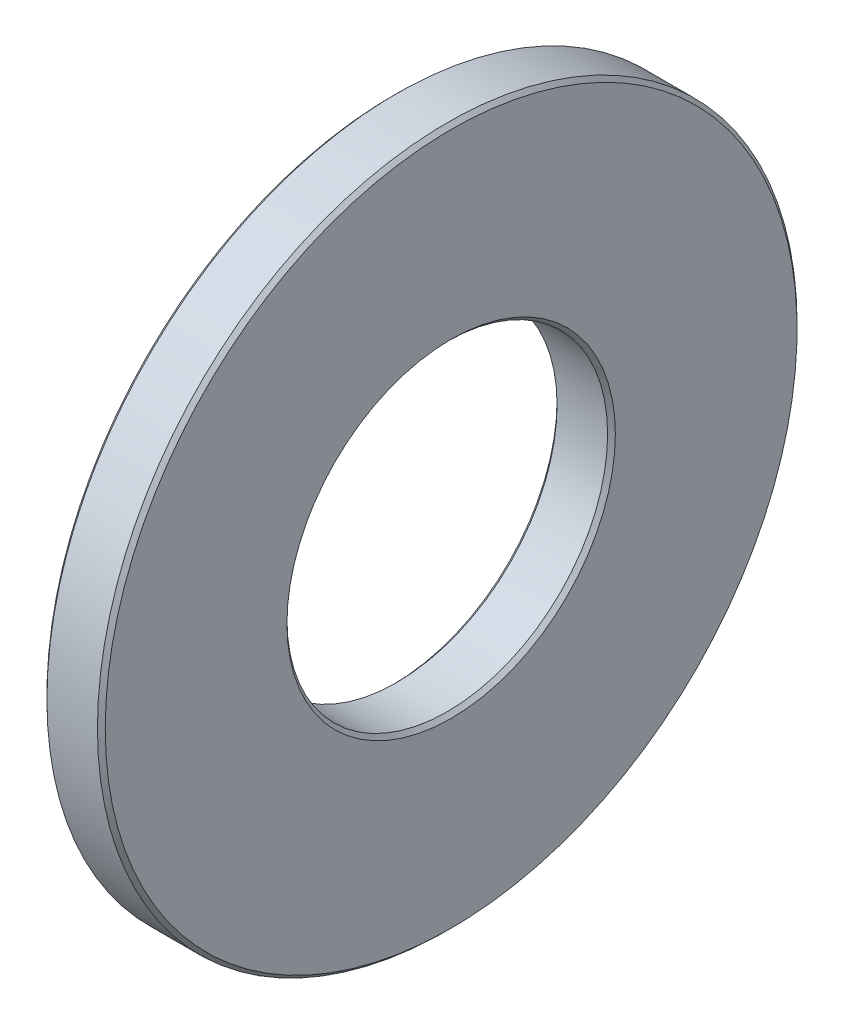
ISO-10303-21;
HEADER;
FILE_DESCRIPTION(('STEP AP214'),'2;1');
FILE_NAME('part.step','',(''),(''),'','','');
FILE_SCHEMA(('AUTOMOTIVE_DESIGN { 1 0 10303 214 1 1 1 1 }'));
ENDSEC;
DATA;
#1=APPLICATION_CONTEXT('core data for automotive mechanical design processes');
#2=APPLICATION_PROTOCOL_DEFINITION('international standard','automotive_design',2000,#1);
#3=PRODUCT_CONTEXT('',#1,'mechanical');
#4=PRODUCT('Part','Part','',(#3));
#5=PRODUCT_RELATED_PRODUCT_CATEGORY('part','',(#4));
#6=PRODUCT_DEFINITION_FORMATION('','',#4);
#7=PRODUCT_DEFINITION_CONTEXT('part definition',#1,'design');
#8=PRODUCT_DEFINITION('design','',#6,#7);
#9=PRODUCT_DEFINITION_SHAPE('','',#8);
#10=(LENGTH_UNIT() NAMED_UNIT(*) SI_UNIT(.MILLI.,.METRE.));
#11=(NAMED_UNIT(*) PLANE_ANGLE_UNIT() SI_UNIT($,.RADIAN.));
#12=(NAMED_UNIT(*) SI_UNIT($,.STERADIAN.) SOLID_ANGLE_UNIT());
#13=UNCERTAINTY_MEASURE_WITH_UNIT(LENGTH_MEASURE(1.E-05),#10,'distance_accuracy_value','');
#14=(GEOMETRIC_REPRESENTATION_CONTEXT(3) GLOBAL_UNCERTAINTY_ASSIGNED_CONTEXT((#13)) GLOBAL_UNIT_ASSIGNED_CONTEXT((#10,
#11,#12)) REPRESENTATION_CONTEXT('',''));
#15=CARTESIAN_POINT('',(0.,0.,0.));
#16=DIRECTION('',(0.,0.,1.));
#17=DIRECTION('',(1.,0.,0.));
#18=AXIS2_PLACEMENT_3D('',#15,#16,#17);
#19=CARTESIAN_POINT('',(0.,4.125,0.));
#20=DIRECTION('',(1.,0.,0.));
#21=DIRECTION('',(0.,0.,-1.));
#22=AXIS2_PLACEMENT_3D('',#19,#20,#21);
#23=PLANE('',#22);
#24=CARTESIAN_POINT('',(0.,0.,0.));
#25=DIRECTION('',(1.,0.,0.));
#26=DIRECTION('',(0.,0.,-1.));
#27=AXIS2_PLACEMENT_3D('',#24,#25,#26);
#28=CIRCLE('',#27,4.225);
#29=CARTESIAN_POINT('',(0.,0.,-4.225));
#30=VERTEX_POINT('',#29);
#31=EDGE_CURVE('E45',#30,#30,#28,.T.);
#32=ORIENTED_EDGE('',*,*,#31,.T.);
#33=EDGE_LOOP('',(#32));
#34=FACE_BOUND('',#33,.T.);
#35=CARTESIAN_POINT('',(0.,0.,0.));
#36=DIRECTION('',(1.,0.,0.));
#37=DIRECTION('',(0.,0.,-1.));
#38=AXIS2_PLACEMENT_3D('',#35,#36,#37);
#39=CIRCLE('',#38,8.9);
#40=CARTESIAN_POINT('',(0.,0.,-8.9));
#41=VERTEX_POINT('',#40);
#42=EDGE_CURVE('E49',#41,#41,#39,.F.);
#43=ORIENTED_EDGE('',*,*,#42,.T.);
#44=EDGE_LOOP('',(#43));
#45=FACE_BOUND('',#44,.T.);
#46=ADVANCED_FACE('F35',(#34,#45),#23,.F.);
#47=CARTESIAN_POINT('',(0.,0.,0.));
#48=DIRECTION('',(-1.,0.,0.));
#49=DIRECTION('',(0.,0.,1.));
#50=AXIS2_PLACEMENT_3D('',#47,#48,#49);
#51=CYLINDRICAL_SURFACE('',#50,9.);
#52=CARTESIAN_POINT('',(1.4,0.,0.));
#53=DIRECTION('',(-1.,0.,0.));
#54=DIRECTION('',(0.,0.,1.));
#55=AXIS2_PLACEMENT_3D('',#52,#53,#54);
#56=CIRCLE('',#55,9.);
#57=CARTESIAN_POINT('',(1.4,0.,9.));
#58=VERTEX_POINT('',#57);
#59=EDGE_CURVE('E10',#58,#58,#56,.T.);
#60=ORIENTED_EDGE('',*,*,#59,.T.);
#61=EDGE_LOOP('',(#60));
#62=FACE_BOUND('',#61,.T.);
#63=CARTESIAN_POINT('',(0.0999999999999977,0.,0.));
#64=DIRECTION('',(1.,0.,0.));
#65=DIRECTION('',(0.,0.,-1.));
#66=AXIS2_PLACEMENT_3D('',#63,#64,#65);
#67=CIRCLE('',#66,9.);
#68=CARTESIAN_POINT('',(0.0999999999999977,0.,-9.));
#69=VERTEX_POINT('',#68);
#70=EDGE_CURVE('E41',#69,#69,#67,.T.);
#71=ORIENTED_EDGE('',*,*,#70,.T.);
#72=EDGE_LOOP('',(#71));
#73=FACE_BOUND('',#72,.T.);
#74=ADVANCED_FACE('F85',(#62,#73),#51,.T.);
#75=CARTESIAN_POINT('',(1.5,4.125,0.));
#76=DIRECTION('',(-1.,0.,0.));
#77=DIRECTION('',(0.,0.,1.));
#78=AXIS2_PLACEMENT_3D('',#75,#76,#77);
#79=PLANE('',#78);
#80=CARTESIAN_POINT('',(1.5,0.,0.));
#81=DIRECTION('',(-1.,0.,0.));
#82=DIRECTION('',(0.,0.,1.));
#83=AXIS2_PLACEMENT_3D('',#80,#81,#82);
#84=CIRCLE('',#83,4.225);
#85=CARTESIAN_POINT('',(1.5,0.,-4.225));
#86=VERTEX_POINT('',#85);
#87=EDGE_CURVE('E60',#86,#86,#84,.T.);
#88=ORIENTED_EDGE('',*,*,#87,.T.);
#89=EDGE_LOOP('',(#88));
#90=FACE_BOUND('',#89,.T.);
#91=CARTESIAN_POINT('',(1.5,0.,0.));
#92=DIRECTION('',(-1.,0.,0.));
#93=DIRECTION('',(0.,0.,1.));
#94=AXIS2_PLACEMENT_3D('',#91,#92,#93);
#95=CIRCLE('',#94,8.9);
#96=CARTESIAN_POINT('',(1.5,0.,8.9));
#97=VERTEX_POINT('',#96);
#98=EDGE_CURVE('E63',#97,#97,#95,.F.);
#99=ORIENTED_EDGE('',*,*,#98,.T.);
#100=EDGE_LOOP('',(#99));
#101=FACE_BOUND('',#100,.T.);
#102=ADVANCED_FACE('F67',(#90,#101),#79,.F.);
#103=CARTESIAN_POINT('',(0.,0.,0.));
#104=DIRECTION('',(-1.,0.,0.));
#105=DIRECTION('',(0.,0.,1.));
#106=AXIS2_PLACEMENT_3D('',#103,#104,#105);
#107=CYLINDRICAL_SURFACE('',#106,4.125);
#108=CARTESIAN_POINT('',(1.4,0.,0.));
#109=DIRECTION('',(-1.,0.,0.));
#110=DIRECTION('',(0.,0.,1.));
#111=AXIS2_PLACEMENT_3D('',#108,#109,#110);
#112=CIRCLE('',#111,4.125);
#113=CARTESIAN_POINT('',(1.4,0.,-4.125));
#114=VERTEX_POINT('',#113);
#115=EDGE_CURVE('E54',#114,#114,#112,.F.);
#116=ORIENTED_EDGE('',*,*,#115,.T.);
#117=EDGE_LOOP('',(#116));
#118=FACE_BOUND('',#117,.T.);
#119=CARTESIAN_POINT('',(0.1,0.,0.));
#120=DIRECTION('',(1.,0.,0.));
#121=DIRECTION('',(0.,0.,-1.));
#122=AXIS2_PLACEMENT_3D('',#119,#120,#121);
#123=CIRCLE('',#122,4.125);
#124=CARTESIAN_POINT('',(0.1,0.,-4.125));
#125=VERTEX_POINT('',#124);
#126=EDGE_CURVE('E57',#125,#125,#123,.F.);
#127=ORIENTED_EDGE('',*,*,#126,.T.);
#128=EDGE_LOOP('',(#127));
#129=FACE_BOUND('',#128,.T.);
#130=ADVANCED_FACE('F97',(#118,#129),#107,.F.);
#131=CARTESIAN_POINT('',(1.5,0.,0.));
#132=DIRECTION('',(1.,0.,0.));
#133=DIRECTION('',(0.,0.,-1.));
#134=AXIS2_PLACEMENT_3D('',#131,#132,#133);
#135=CONICAL_SURFACE('',#134,4.225,0.78539816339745);
#136=CARTESIAN_POINT('',(1.4,0.,-4.125));
#137=CARTESIAN_POINT('',(1.40104166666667,0.,-4.12604166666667));
#138=CARTESIAN_POINT('',(1.40208333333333,0.,-4.12708333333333));
#139=CARTESIAN_POINT('',(1.40416666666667,0.,-4.12916666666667));
#140=CARTESIAN_POINT('',(1.40520833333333,0.,-4.13020833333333));
#141=CARTESIAN_POINT('',(1.40729166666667,0.,-4.13229166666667));
#142=CARTESIAN_POINT('',(1.40833333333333,0.,-4.13333333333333));
#143=CARTESIAN_POINT('',(1.41041666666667,0.,-4.13541666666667));
#144=CARTESIAN_POINT('',(1.41145833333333,0.,-4.13645833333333));
#145=CARTESIAN_POINT('',(1.41354166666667,0.,-4.13854166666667));
#146=CARTESIAN_POINT('',(1.41458333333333,0.,-4.13958333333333));
#147=CARTESIAN_POINT('',(1.41666666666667,0.,-4.14166666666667));
#148=CARTESIAN_POINT('',(1.41770833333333,0.,-4.14270833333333));
#149=CARTESIAN_POINT('',(1.41979166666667,0.,-4.14479166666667));
#150=CARTESIAN_POINT('',(1.42083333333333,0.,-4.14583333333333));
#151=CARTESIAN_POINT('',(1.42291666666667,0.,-4.14791666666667));
#152=CARTESIAN_POINT('',(1.42395833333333,0.,-4.14895833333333));
#153=CARTESIAN_POINT('',(1.42604166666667,0.,-4.15104166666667));
#154=CARTESIAN_POINT('',(1.42708333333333,0.,-4.15208333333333));
#155=CARTESIAN_POINT('',(1.42916666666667,0.,-4.15416666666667));
#156=CARTESIAN_POINT('',(1.43020833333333,0.,-4.15520833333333));
#157=CARTESIAN_POINT('',(1.43229166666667,0.,-4.15729166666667));
#158=CARTESIAN_POINT('',(1.43333333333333,0.,-4.15833333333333));
#159=CARTESIAN_POINT('',(1.43541666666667,0.,-4.16041666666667));
#160=CARTESIAN_POINT('',(1.43645833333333,0.,-4.16145833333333));
#161=CARTESIAN_POINT('',(1.43854166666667,0.,-4.16354166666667));
#162=CARTESIAN_POINT('',(1.43958333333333,0.,-4.16458333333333));
#163=CARTESIAN_POINT('',(1.44166666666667,0.,-4.16666666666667));
#164=CARTESIAN_POINT('',(1.44270833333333,0.,-4.16770833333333));
#165=CARTESIAN_POINT('',(1.44479166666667,0.,-4.16979166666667));
#166=CARTESIAN_POINT('',(1.44583333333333,0.,-4.17083333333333));
#167=CARTESIAN_POINT('',(1.44791666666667,0.,-4.17291666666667));
#168=CARTESIAN_POINT('',(1.44895833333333,0.,-4.17395833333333));
#169=CARTESIAN_POINT('',(1.45104166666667,0.,-4.17604166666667));
#170=CARTESIAN_POINT('',(1.45208333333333,0.,-4.17708333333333));
#171=CARTESIAN_POINT('',(1.45416666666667,0.,-4.17916666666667));
#172=CARTESIAN_POINT('',(1.45520833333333,0.,-4.18020833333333));
#173=CARTESIAN_POINT('',(1.45729166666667,0.,-4.18229166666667));
#174=CARTESIAN_POINT('',(1.45833333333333,0.,-4.18333333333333));
#175=CARTESIAN_POINT('',(1.46041666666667,0.,-4.18541666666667));
#176=CARTESIAN_POINT('',(1.46145833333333,0.,-4.18645833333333));
#177=CARTESIAN_POINT('',(1.46354166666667,0.,-4.18854166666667));
#178=CARTESIAN_POINT('',(1.46458333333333,0.,-4.18958333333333));
#179=CARTESIAN_POINT('',(1.46666666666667,0.,-4.19166666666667));
#180=CARTESIAN_POINT('',(1.46770833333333,0.,-4.19270833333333));
#181=CARTESIAN_POINT('',(1.46979166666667,0.,-4.19479166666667));
#182=CARTESIAN_POINT('',(1.47083333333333,0.,-4.19583333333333));
#183=CARTESIAN_POINT('',(1.47291666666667,0.,-4.19791666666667));
#184=CARTESIAN_POINT('',(1.47395833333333,0.,-4.19895833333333));
#185=CARTESIAN_POINT('',(1.47604166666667,0.,-4.20104166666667));
#186=CARTESIAN_POINT('',(1.47708333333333,0.,-4.20208333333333));
#187=CARTESIAN_POINT('',(1.47916666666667,0.,-4.20416666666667));
#188=CARTESIAN_POINT('',(1.48020833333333,0.,-4.20520833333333));
#189=CARTESIAN_POINT('',(1.48229166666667,0.,-4.20729166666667));
#190=CARTESIAN_POINT('',(1.48333333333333,0.,-4.20833333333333));
#191=CARTESIAN_POINT('',(1.48541666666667,0.,-4.21041666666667));
#192=CARTESIAN_POINT('',(1.48645833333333,0.,-4.21145833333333));
#193=CARTESIAN_POINT('',(1.48854166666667,0.,-4.21354166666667));
#194=CARTESIAN_POINT('',(1.48958333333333,0.,-4.21458333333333));
#195=CARTESIAN_POINT('',(1.49166666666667,0.,-4.21666666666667));
#196=CARTESIAN_POINT('',(1.49270833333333,0.,-4.21770833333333));
#197=CARTESIAN_POINT('',(1.49479166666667,0.,-4.21979166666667));
#198=CARTESIAN_POINT('',(1.49583333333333,0.,-4.22083333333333));
#199=CARTESIAN_POINT('',(1.49791666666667,0.,-4.22291666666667));
#200=CARTESIAN_POINT('',(1.49895833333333,0.,-4.22395833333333));
#201=CARTESIAN_POINT('',(1.5,0.,-4.225));
#202=B_SPLINE_CURVE_WITH_KNOTS('',3,(#136,#137,#138,#139,#140,#141,#142,#143,#144,#145,#146,
#147,#148,#149,#150,#151,#152,#153,#154,#155,#156,#157,#158,#159,#160,#161,#162,#163,#164,#165,
#166,#167,#168,#169,#170,#171,#172,#173,#174,#175,#176,#177,#178,#179,#180,#181,#182,#183,#184,
#185,#186,#187,#188,#189,#190,#191,#192,#193,#194,#195,#196,#197,#198,#199,#200,#201),
.UNSPECIFIED.,.F.,.F.,(4,2,2,2,2,2,2,2,2,2,2,2,2,2,2,2,2,2,2,2,2,2,2,2,2,2,2,2,2,2,2,2,4),(0.,
0.0044194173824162,0.00883883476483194,0.0132582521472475,0.0176776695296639,0.0220970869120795,
0.0265165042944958,0.0309359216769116,0.0353553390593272,0.0397747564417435,0.0441941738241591,
0.0486135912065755,0.0530330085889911,0.0574524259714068,0.061871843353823,0.0662912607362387,
0.0707106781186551,0.0751300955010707,0.0795495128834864,0.0839689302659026,0.0883883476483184,
0.0928077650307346,0.0972271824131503,0.101646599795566,0.106066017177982,0.110485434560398,
0.114904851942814,0.11932426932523,0.123743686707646,0.128163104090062,0.132582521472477,
0.137001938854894,0.141421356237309),.UNSPECIFIED.);
#203=EDGE_CURVE('BSEAM81',#114,#86,#202,.T.);
#204=ORIENTED_EDGE('',*,*,#115,.F.);
#205=ORIENTED_EDGE('',*,*,#87,.F.);
#206=ORIENTED_EDGE('',*,*,#203,.T.);
#207=ORIENTED_EDGE('',*,*,#203,.F.);
#208=EDGE_LOOP('',(#204,#206,#205,#207));
#209=FACE_BOUND('',#208,.T.);
#210=ADVANCED_FACE('F81',(#209),#135,.F.);
#211=CARTESIAN_POINT('',(0.1,0.,0.));
#212=DIRECTION('',(-1.,0.,0.));
#213=DIRECTION('',(0.,0.,1.));
#214=AXIS2_PLACEMENT_3D('',#211,#212,#213);
#215=CONICAL_SURFACE('',#214,4.125,0.785398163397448);
#216=ORIENTED_EDGE('',*,*,#31,.F.);
#217=EDGE_LOOP('',(#216));
#218=FACE_BOUND('',#217,.T.);
#219=ORIENTED_EDGE('',*,*,#126,.F.);
#220=EDGE_LOOP('',(#219));
#221=FACE_BOUND('',#220,.T.);
#222=ADVANCED_FACE('F73',(#218,#221),#215,.F.);
#223=CARTESIAN_POINT('',(1.4,0.,0.));
#224=DIRECTION('',(-1.,0.,0.));
#225=DIRECTION('',(0.,0.,1.));
#226=AXIS2_PLACEMENT_3D('',#223,#224,#225);
#227=CONICAL_SURFACE('',#226,9.,0.785398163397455);
#228=ORIENTED_EDGE('',*,*,#98,.F.);
#229=EDGE_LOOP('',(#228));
#230=FACE_BOUND('',#229,.T.);
#231=ORIENTED_EDGE('',*,*,#59,.F.);
#232=EDGE_LOOP('',(#231));
#233=FACE_BOUND('',#232,.T.);
#234=ADVANCED_FACE('F69',(#230,#233),#227,.T.);
#235=CARTESIAN_POINT('',(0.,0.,0.));
#236=DIRECTION('',(1.,0.,0.));
#237=DIRECTION('',(0.,0.,-1.));
#238=AXIS2_PLACEMENT_3D('',#235,#236,#237);
#239=CONICAL_SURFACE('',#238,8.9,0.785398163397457);
#240=ORIENTED_EDGE('',*,*,#70,.F.);
#241=EDGE_LOOP('',(#240));
#242=FACE_BOUND('',#241,.T.);
#243=ORIENTED_EDGE('',*,*,#42,.F.);
#244=EDGE_LOOP('',(#243));
#245=FACE_BOUND('',#244,.T.);
#246=ADVANCED_FACE('F72',(#242,#245),#239,.T.);
#247=CLOSED_SHELL('',(#46,#74,#102,#130,#210,#222,#234,#246));
#248=MANIFOLD_SOLID_BREP('B2',#247);
#249=ADVANCED_BREP_SHAPE_REPRESENTATION('',(#18,#248),#14);
#250=SHAPE_DEFINITION_REPRESENTATION(#9,#249);
ENDSEC;
END-ISO-10303-21;
